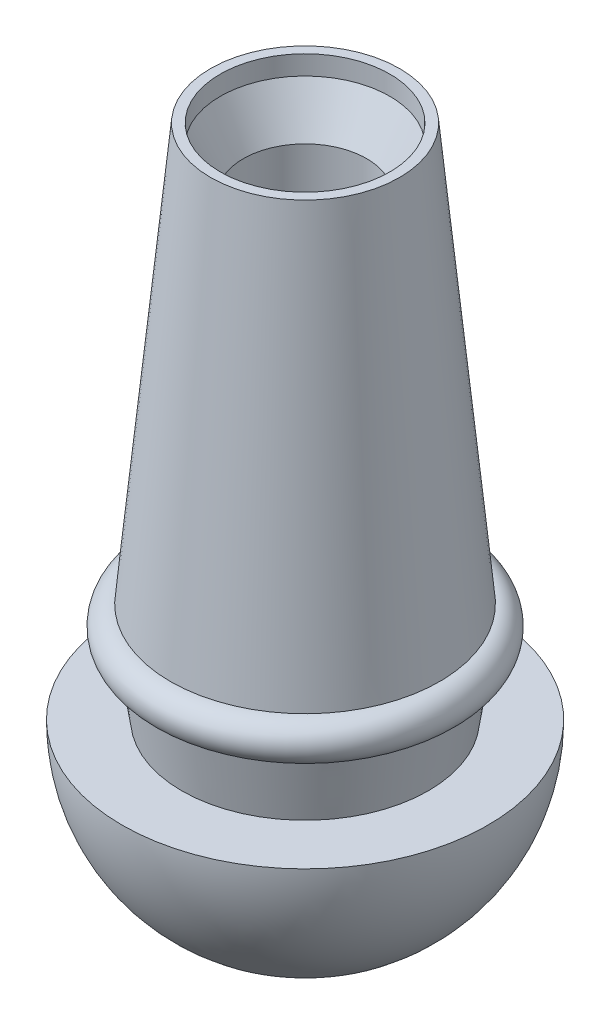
from build123d import *


with BuildPart() as part:
    # Esquisse1 → R_volution1 (revolve)
    with BuildSketch(Plane.XY, mode=Mode.PRIVATE) as r_volution1_sk:
        with BuildLine():
            Line((44, 0), (49, 0))
            Line((49, 0), (69.845782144, -216.001189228))
            ThreePointArc((69.845782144, -216.001189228), (79.98704298, -226.508893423), (68.830233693, -235.931346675))
            Line((68.830233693, -235.931346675), (64, -268))
            Line((64, -268), (94.868329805, -268))
            ThreePointArc((94.868329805, -268), (76.961191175, -323.470488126), (30, -358))
            Line((30, -358), (30, -182.2))
            Line((30, -182.2), (32, -163))
            Line((32, -163), (32, -32))
            Line((32, -32), (44, -10))
            Line((44, -10), (44, 0))
        make_face()
    revolve(r_volution1_sk.sketch.rotate(Axis((0, 0, 0), (0, -1, 0)), 90), axis=Axis((0, 0, 0), (0, -1, 0)))


solid = part.part
